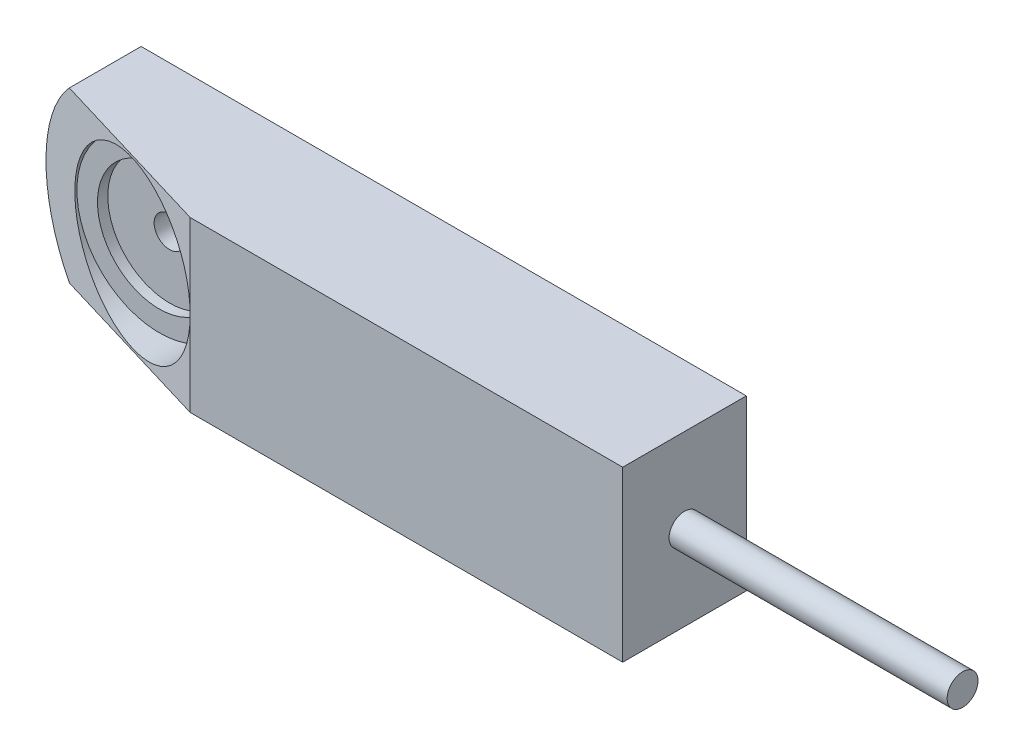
from build123d import *

# Parameters (mm, degrees)
BOSS_EXTRUDE1_DEPTH      = 60
BOSS_EXTRUDE1_DEPTH_BACK = 60
SKETCH1_W                = 2000
SKETCH1_H                = 240
CUT_EXTRUDE1_DEPTH       = 125
CUT_EXTRUDE1_DEPTH_BACK  = 203
SKETCH3_R                = 80
CUT_EXTRUDE2_DEPTH       = 332
CUT_EXTRUDE3_DEPTH       = 274
CUT_EXTRUDE3_DEPTH_BACK  = 321
SKETCH5_R                = 80
SKETCH5_R_2              = 60
BOSS_EXTRUDE2_DEPTH      = 10
SKETCH6_R                = 15
BOSS_EXTRUDE3_DEPTH      = 530
SKETCH7_R                = 15
CUT_EXTRUDE4_DEPTH       = 530
CUT_EXTRUDE5_DEPTH       = 66
CUT_EXTRUDE5_DEPTH_BACK  = 193
SKETCH9_W                = 283.673506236
SKETCH9_H                = 374.258323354
CUT_EXTRUDE6_DEPTH       = 177
CUT_EXTRUDE6_DEPTH_BACK  = 344
SKETCH10_W               = 1477.962805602
SKETCH10_H               = 445.772652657
BOSS_EXTRUDE4_DEPTH      = 80
BOSS_EXTRUDE4_DEPTH_BACK = 80
SKETCH11_W               = 50
SKETCH11_H               = 160
SKETCH12_W               = 30
SKETCH12_H               = 70
SKETCH13_R               = 15
CUT_EXTRUDE7_DEPTH       = 523
CUT_EXTRUDE8_DEPTH       = 171
CUT_EXTRUDE8_DEPTH_BACK  = 375
SKETCH14_W               = 386.487273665
SKETCH14_H               = 196.609942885
SKETCH15_W               = 270
SKETCH15_H               = 15
CUT_EXTRUDE9_DEPTH       = 94
CUT_EXTRUDE9_DEPTH_BACK  = 399
SKETCH16_R               = 15
CUT_EXTRUDE10_DEPTH      = 94
CUT_EXTRUDE10_DEPTH_BACK = 145
SKETCH17_W               = 744.678711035
SKETCH17_H               = 97.593221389
SKETCH17_W_2             = 773.320199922
SKETCH17_H_2             = 59.404569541


with BuildPart() as part:
    # Sketch1 → Boss-Extrude1 (new, two sides: drawn at the far end of the back side and taken through both)
    with BuildSketch(Plane.XY.offset(-BOSS_EXTRUDE1_DEPTH_BACK)):
        Rectangle(SKETCH1_W, SKETCH1_H)
    extrude(amount=BOSS_EXTRUDE1_DEPTH + BOSS_EXTRUDE1_DEPTH_BACK)

    # Sketch2 → Cut-Extrude1 (cut, two sides: drawn at the far end of the back side and taken through both)
    with BuildSketch(Plane.XY.offset(-CUT_EXTRUDE1_DEPTH_BACK)):
        with BuildLine():
            Line((-880, 120), (-1006.825608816, 281.646305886))
            Line((-1006.825608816, 281.646305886), (-1134.79266536, 120))
            Line((-1134.79266536, 120), (-1063.819339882, -191.509197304))
            Line((-1063.819339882, -191.509197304), (-862.728251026, -191.509197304))
            Line((-862.728251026, -191.509197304), (-880, -120))
            ThreePointArc((-880, -120), (-1000, 0), (-880, 120))
        make_face()
        with BuildLine():
            Line((880, 120), (893.27601501, 184.167147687))
            Line((893.27601501, 184.167147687), (1104.453001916, 184.167147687))
            Line((1104.453001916, 184.167147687), (1104.453001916, -100.878332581))
            Line((1104.453001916, -100.878332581), (1008.858481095, -155.754598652))
            Line((1008.858481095, -155.754598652), (880, -120))
            ThreePointArc((880, -120), (1000, 0), (880, 120))
        make_face()
    extrude(amount=CUT_EXTRUDE1_DEPTH + CUT_EXTRUDE1_DEPTH_BACK, mode=Mode.SUBTRACT)

    # Sketch3 → Cut-Extrude2 (cut)
    with BuildSketch(Plane.XY):
        with Locations(Location((-880, 0, 0), (0, 0, 180))):
            Circle(SKETCH3_R)
        with Locations(Location((880, 0, 0), (0, 0, 180))):
            Circle(SKETCH3_R)
    extrude(amount=CUT_EXTRUDE2_DEPTH, mode=Mode.SUBTRACT)

    # Sketch4 → Cut-Extrude3 (cut, two sides: drawn at the far end of the back side and taken through both)
    with BuildSketch(Plane(origin=(0, 0, 0), x_dir=(1, 0, 0), z_dir=(0, 1, 0)).offset(-CUT_EXTRUDE3_DEPTH_BACK)):
        Polygon((-800, -60), (-1000, 0), (-1030.608079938, -49.976511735), (-1007.288101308, -94.135620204), (-816.758914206, -82.723715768), align=None)
        Polygon((800, -60), (1000, 0), (1023.971167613, -45.392211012), (975.065808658, -111.70387433), (805.564412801, -78.548042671), align=None)
    extrude(amount=CUT_EXTRUDE3_DEPTH + CUT_EXTRUDE3_DEPTH_BACK, mode=Mode.SUBTRACT)

    # Sketch5 → Boss-Extrude2 (add)
    with BuildSketch(Plane.XY):
        with Locations((-880, 0)):
            Circle(SKETCH5_R)
        with Locations((-880, 0)):
            Circle(SKETCH5_R_2, mode=Mode.SUBTRACT)
    extrude(amount=BOSS_EXTRUDE2_DEPTH)

    # Sketch6 → Boss-Extrude3 (add)
    with BuildSketch(Plane.XY):
        with Locations((-880, 0)):
            Circle(SKETCH6_R)
    extrude(amount=-BOSS_EXTRUDE3_DEPTH)

    # Sketch7 → Cut-Extrude4 (cut)
    with BuildSketch(Plane.XY):
        with Locations((880, 0)):
            Circle(SKETCH7_R)
    extrude(amount=-CUT_EXTRUDE4_DEPTH, mode=Mode.SUBTRACT)

    # Sketch9 → Cut-Extrude5 (cut, two sides: drawn at the far end of the back side and taken through both)
    with BuildSketch(Plane(origin=(0, 0, 0), x_dir=(1, 0, 0), z_dir=(0, 1, 0)).offset(-CUT_EXTRUDE5_DEPTH_BACK)):
        with Locations((-879.626250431, 557.129161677)):
            Rectangle(SKETCH9_W, SKETCH9_H)
    extrude(amount=CUT_EXTRUDE5_DEPTH + CUT_EXTRUDE5_DEPTH_BACK, mode=Mode.SUBTRACT)

    # Sketch10 → Cut-Extrude6 (cut, two sides: drawn at the far end of the back side and taken through both)
    with BuildSketch(Plane(origin=(0, 0, 0), x_dir=(1, 0, 0), z_dir=(0, 1, 0)).offset(-CUT_EXTRUDE6_DEPTH_BACK)):
        with Locations((358.981402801, 33.425640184)):
            Rectangle(SKETCH10_W, SKETCH10_H)
    extrude(amount=CUT_EXTRUDE6_DEPTH + CUT_EXTRUDE6_DEPTH_BACK, mode=Mode.SUBTRACT)

    # Sketch11 → Boss-Extrude4 (add, two sides: drawn at the far end of the back side and taken through both)
    with BuildSketch(Plane(origin=(0, 0, 0), x_dir=(1, 0, 0), z_dir=(0, 1, 0)).offset(-BOSS_EXTRUDE4_DEPTH_BACK)):
        with Locations((-405, 140)):
            Rectangle(SKETCH11_W, SKETCH11_H)
    extrude(amount=BOSS_EXTRUDE4_DEPTH + BOSS_EXTRUDE4_DEPTH_BACK)

    # Sketch12 → Cut-Revolve1 (revolve, cut)
    with BuildSketch(Plane(origin=(0, 0, 0), x_dir=(1, 0, 0), z_dir=(0, 1, 0)), mode=Mode.PRIVATE) as cut_revolve1_sk:
        with Locations((-415, 175)):
            Rectangle(SKETCH12_W, SKETCH12_H)
    revolve(cut_revolve1_sk.sketch.rotate(Axis((-462.366254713, 0, -140), (1, 0, 0)), 180), axis=Axis((-462.366254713, 0, -140), (1, 0, 0)), mode=Mode.SUBTRACT)

    # Sketch13 → Cut-Extrude7 (cut)
    with BuildSketch(Plane(origin=(0, 0, 0), x_dir=(0, 0, -1), z_dir=(1, 0, 0))):
        with Locations(Location((140, 0, 0), (0, 0, 180))):
            Circle(SKETCH13_R)
    extrude(amount=-CUT_EXTRUDE7_DEPTH, mode=Mode.SUBTRACT)

    # Sketch14 → Cut-Extrude8 (cut, two sides: drawn at the far end of the back side and taken through both)
    with BuildSketch(Plane(origin=(0, 0, 0), x_dir=(1, 0, 0), z_dir=(0, 1, 0)).offset(-CUT_EXTRUDE8_DEPTH_BACK)):
        with Locations((-486.78011423, 158.304971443)):
            Rectangle(SKETCH14_W, SKETCH14_H)
    extrude(amount=CUT_EXTRUDE8_DEPTH + CUT_EXTRUDE8_DEPTH_BACK, mode=Mode.SUBTRACT)

    # Sketch15 → Revolve1 (revolve)
    with BuildSketch(Plane(origin=(0, 0, 0), x_dir=(1, 0, 0), z_dir=(0, 1, 0)), mode=Mode.PRIVATE) as revolve1_sk:
        with Locations((-245, 7.5)):
            Rectangle(SKETCH15_W, SKETCH15_H)
    revolve(revolve1_sk.sketch.rotate(Axis((-380, 0, 0), (1, 0, 0)), 180), axis=Axis((-380, 0, 0), (1, 0, 0)))

    # Sketch16 → Cut-Extrude9 (cut, two sides: drawn at the far end of the back side and taken through both)
    with BuildSketch(Plane.XY.offset(-CUT_EXTRUDE9_DEPTH_BACK)):
        with Locations((-880, 0)):
            Circle(SKETCH16_R)
    extrude(amount=CUT_EXTRUDE9_DEPTH + CUT_EXTRUDE9_DEPTH_BACK, mode=Mode.SUBTRACT)

    # Sketch17 → Cut-Extrude10 (cut, two sides: drawn at the far end of the back side and taken through both)
    with BuildSketch(Plane.XY.offset(-CUT_EXTRUDE10_DEPTH_BACK)):
        with Locations((-723.13614772, 130.796610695)):
            Rectangle(SKETCH17_W, SKETCH17_H)
        with Locations((-745.94325924, -111.702284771)):
            Rectangle(SKETCH17_W_2, SKETCH17_H_2)
    extrude(amount=CUT_EXTRUDE10_DEPTH + CUT_EXTRUDE10_DEPTH_BACK, mode=Mode.SUBTRACT)


solid = part.part
